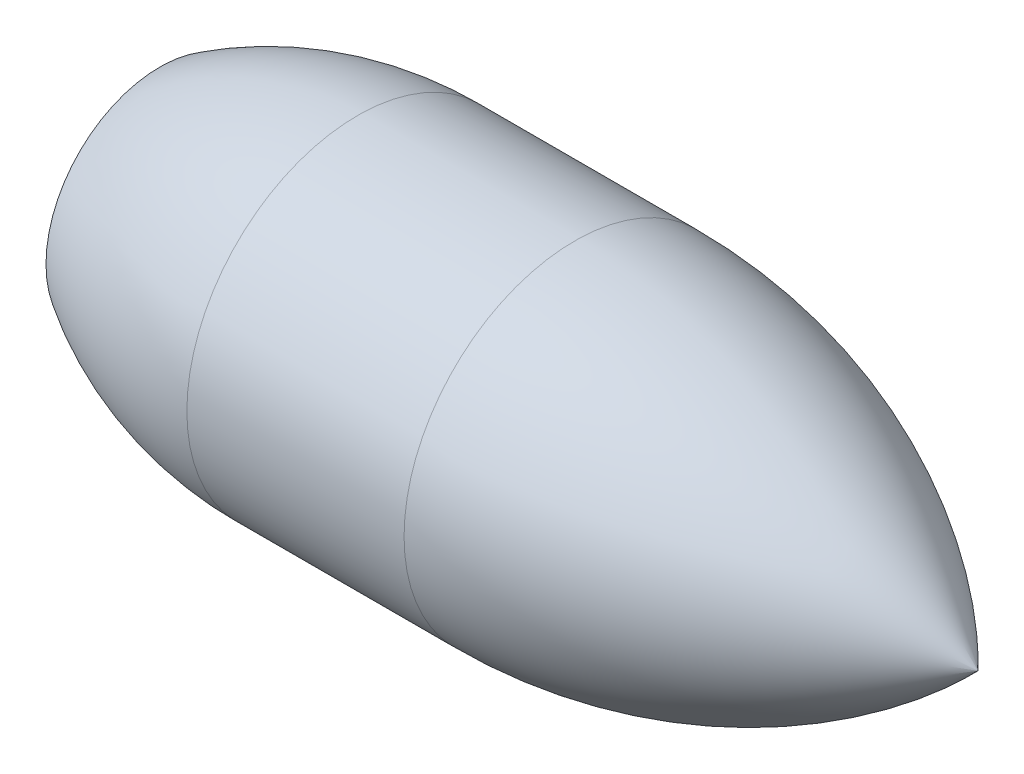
ISO-10303-21;
HEADER;
FILE_DESCRIPTION(('STEP AP214'),'2;1');
FILE_NAME('part.step','',(''),(''),'','','');
FILE_SCHEMA(('AUTOMOTIVE_DESIGN { 1 0 10303 214 1 1 1 1 }'));
ENDSEC;
DATA;
#1=APPLICATION_CONTEXT('core data for automotive mechanical design processes');
#2=APPLICATION_PROTOCOL_DEFINITION('international standard','automotive_design',2000,#1);
#3=PRODUCT_CONTEXT('',#1,'mechanical');
#4=PRODUCT('Part','Part','',(#3));
#5=PRODUCT_RELATED_PRODUCT_CATEGORY('part','',(#4));
#6=PRODUCT_DEFINITION_FORMATION('','',#4);
#7=PRODUCT_DEFINITION_CONTEXT('part definition',#1,'design');
#8=PRODUCT_DEFINITION('design','',#6,#7);
#9=PRODUCT_DEFINITION_SHAPE('','',#8);
#10=(LENGTH_UNIT() NAMED_UNIT(*) SI_UNIT(.MILLI.,.METRE.));
#11=(NAMED_UNIT(*) PLANE_ANGLE_UNIT() SI_UNIT($,.RADIAN.));
#12=(NAMED_UNIT(*) SI_UNIT($,.STERADIAN.) SOLID_ANGLE_UNIT());
#13=UNCERTAINTY_MEASURE_WITH_UNIT(LENGTH_MEASURE(1.E-05),#10,'distance_accuracy_value','');
#14=(GEOMETRIC_REPRESENTATION_CONTEXT(3) GLOBAL_UNCERTAINTY_ASSIGNED_CONTEXT((#13)) GLOBAL_UNIT_ASSIGNED_CONTEXT((#10,
#11,#12)) REPRESENTATION_CONTEXT('',''));
#15=CARTESIAN_POINT('',(0.,0.,0.));
#16=DIRECTION('',(0.,0.,1.));
#17=DIRECTION('',(1.,0.,0.));
#18=AXIS2_PLACEMENT_3D('',#15,#16,#17);
#19=CARTESIAN_POINT('',(87.63,0.,0.));
#20=DIRECTION('',(-1.,0.,0.));
#21=DIRECTION('',(0.,0.,1.));
#22=AXIS2_PLACEMENT_3D('',#19,#20,#21);
#23=CYLINDRICAL_SURFACE('',#22,18.288);
#24=CARTESIAN_POINT('',(21.1848567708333,0.,0.));
#25=DIRECTION('',(-1.,0.,0.));
#26=DIRECTION('',(0.,0.,1.));
#27=AXIS2_PLACEMENT_3D('',#24,#25,#26);
#28=CIRCLE('',#27,18.288);
#29=CARTESIAN_POINT('',(21.1848567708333,0.,18.288));
#30=VERTEX_POINT('',#29);
#31=EDGE_CURVE('E33',#30,#30,#28,.T.);
#32=ORIENTED_EDGE('',*,*,#31,.F.);
#33=EDGE_LOOP('',(#32));
#34=FACE_BOUND('',#33,.T.);
#35=CARTESIAN_POINT('',(44.45,0.,0.));
#36=DIRECTION('',(-1.,0.,0.));
#37=DIRECTION('',(0.,0.,1.));
#38=AXIS2_PLACEMENT_3D('',#35,#36,#37);
#39=CIRCLE('',#38,18.288);
#40=CARTESIAN_POINT('',(44.45,0.,18.288));
#41=VERTEX_POINT('',#40);
#42=EDGE_CURVE('E37',#41,#41,#39,.T.);
#43=ORIENTED_EDGE('',*,*,#42,.T.);
#44=EDGE_LOOP('',(#43));
#45=FACE_BOUND('',#44,.T.);
#46=ADVANCED_FACE('F27',(#34,#45),#23,.T.);
#47=CARTESIAN_POINT('',(21.1848567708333,0.,0.));
#48=DIRECTION('',(-1.,0.,0.));
#49=DIRECTION('',(0.,0.,1.));
#50=AXIS2_PLACEMENT_3D('',#47,#48,#49);
#51=DEGENERATE_TOROIDAL_SURFACE('',#50,21.5708724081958,39.8588724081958,.F.);
#52=CARTESIAN_POINT('',(0.,0.,0.));
#53=DIRECTION('',(-1.,0.,0.));
#54=DIRECTION('',(0.,0.,1.));
#55=AXIS2_PLACEMENT_3D('',#52,#53,#54);
#56=CIRCLE('',#55,12.192);
#57=CARTESIAN_POINT('',(0.,0.,12.192));
#58=VERTEX_POINT('',#57);
#59=EDGE_CURVE('E10',#58,#58,#56,.T.);
#60=ORIENTED_EDGE('',*,*,#59,.F.);
#61=EDGE_LOOP('',(#60));
#62=FACE_BOUND('',#61,.T.);
#63=ORIENTED_EDGE('',*,*,#31,.T.);
#64=EDGE_LOOP('',(#63));
#65=FACE_BOUND('',#64,.T.);
#66=ADVANCED_FACE('F58',(#62,#65),#51,.F.);
#67=CARTESIAN_POINT('',(0.,0.,0.));
#68=DIRECTION('',(1.,0.,0.));
#69=DIRECTION('',(0.,0.,-1.));
#70=AXIS2_PLACEMENT_3D('',#67,#68,#69);
#71=PLANE('',#70);
#72=CARTESIAN_POINT('',(0.,0.,0.));
#73=DIRECTION('',(-1.,0.,0.));
#74=DIRECTION('',(0.,0.,1.));
#75=AXIS2_PLACEMENT_3D('',#72,#73,#74);
#76=CIRCLE('',#75,7.9375);
#77=CARTESIAN_POINT('',(0.,0.,7.9375));
#78=VERTEX_POINT('',#77);
#79=EDGE_CURVE('E49',#78,#78,#76,.T.);
#80=ORIENTED_EDGE('',*,*,#79,.F.);
#81=EDGE_LOOP('',(#80));
#82=FACE_BOUND('',#81,.T.);
#83=ORIENTED_EDGE('',*,*,#59,.T.);
#84=EDGE_LOOP('',(#83));
#85=FACE_BOUND('',#84,.T.);
#86=ADVANCED_FACE('F55',(#82,#85),#71,.F.);
#87=CARTESIAN_POINT('',(44.45,0.,0.));
#88=DIRECTION('',(-1.,0.,0.));
#89=DIRECTION('',(0.,0.,1.));
#90=AXIS2_PLACEMENT_3D('',#87,#88,#89);
#91=DEGENERATE_TOROIDAL_SURFACE('',#90,41.8524678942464,60.1404678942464,.F.);
#92=CARTESIAN_POINT('',(87.63,0.,0.));
#93=DIRECTION('',(-1.,0.,0.));
#94=DIRECTION('',(0.,0.,1.));
#95=AXIS2_PLACEMENT_3D('',#92,#93,#94);
#96=CIRCLE('',#95,0.00877287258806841);
#97=CARTESIAN_POINT('',(87.63,0.,0.00877287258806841));
#98=VERTEX_POINT('',#97);
#99=EDGE_CURVE('E41',#98,#98,#96,.T.);
#100=ORIENTED_EDGE('',*,*,#99,.T.);
#101=EDGE_LOOP('',(#100));
#102=FACE_BOUND('',#101,.T.);
#103=ORIENTED_EDGE('',*,*,#42,.F.);
#104=EDGE_LOOP('',(#103));
#105=FACE_BOUND('',#104,.T.);
#106=ADVANCED_FACE('F57',(#102,#105),#91,.F.);
#107=CARTESIAN_POINT('',(87.63,0.,0.));
#108=DIRECTION('',(1.,0.,0.));
#109=DIRECTION('',(0.,0.,-1.));
#110=AXIS2_PLACEMENT_3D('',#107,#108,#109);
#111=PLANE('',#110);
#112=ORIENTED_EDGE('',*,*,#99,.F.);
#113=EDGE_LOOP('',(#112));
#114=FACE_BOUND('',#113,.T.);
#115=ADVANCED_FACE('F65',(#114),#111,.T.);
#116=CARTESIAN_POINT('',(24.13,0.,0.));
#117=DIRECTION('',(-1.,0.,0.));
#118=DIRECTION('',(0.,0.,1.));
#119=AXIS2_PLACEMENT_3D('',#116,#117,#118);
#120=CYLINDRICAL_SURFACE('',#119,7.9375);
#121=CARTESIAN_POINT('',(24.13,0.,0.));
#122=DIRECTION('',(-1.,0.,0.));
#123=DIRECTION('',(0.,0.,1.));
#124=AXIS2_PLACEMENT_3D('',#121,#122,#123);
#125=CIRCLE('',#124,7.9375);
#126=CARTESIAN_POINT('',(24.13,0.,7.9375));
#127=VERTEX_POINT('',#126);
#128=EDGE_CURVE('E46',#127,#127,#125,.T.);
#129=ORIENTED_EDGE('',*,*,#128,.F.);
#130=EDGE_LOOP('',(#129));
#131=FACE_BOUND('',#130,.T.);
#132=ORIENTED_EDGE('',*,*,#79,.T.);
#133=EDGE_LOOP('',(#132));
#134=FACE_BOUND('',#133,.T.);
#135=ADVANCED_FACE('F53',(#131,#134),#120,.F.);
#136=CARTESIAN_POINT('',(24.13,0.,0.));
#137=DIRECTION('',(-1.,0.,0.));
#138=DIRECTION('',(0.,0.,1.));
#139=AXIS2_PLACEMENT_3D('',#136,#137,#138);
#140=PLANE('',#139);
#141=ORIENTED_EDGE('',*,*,#128,.T.);
#142=EDGE_LOOP('',(#141));
#143=FACE_BOUND('',#142,.T.);
#144=ADVANCED_FACE('F96',(#143),#140,.T.);
#145=CLOSED_SHELL('',(#46,#66,#86,#106,#115,#135,#144));
#146=MANIFOLD_SOLID_BREP('B2',#145);
#147=ADVANCED_BREP_SHAPE_REPRESENTATION('',(#18,#146),#14);
#148=SHAPE_DEFINITION_REPRESENTATION(#9,#147);
ENDSEC;
END-ISO-10303-21;
